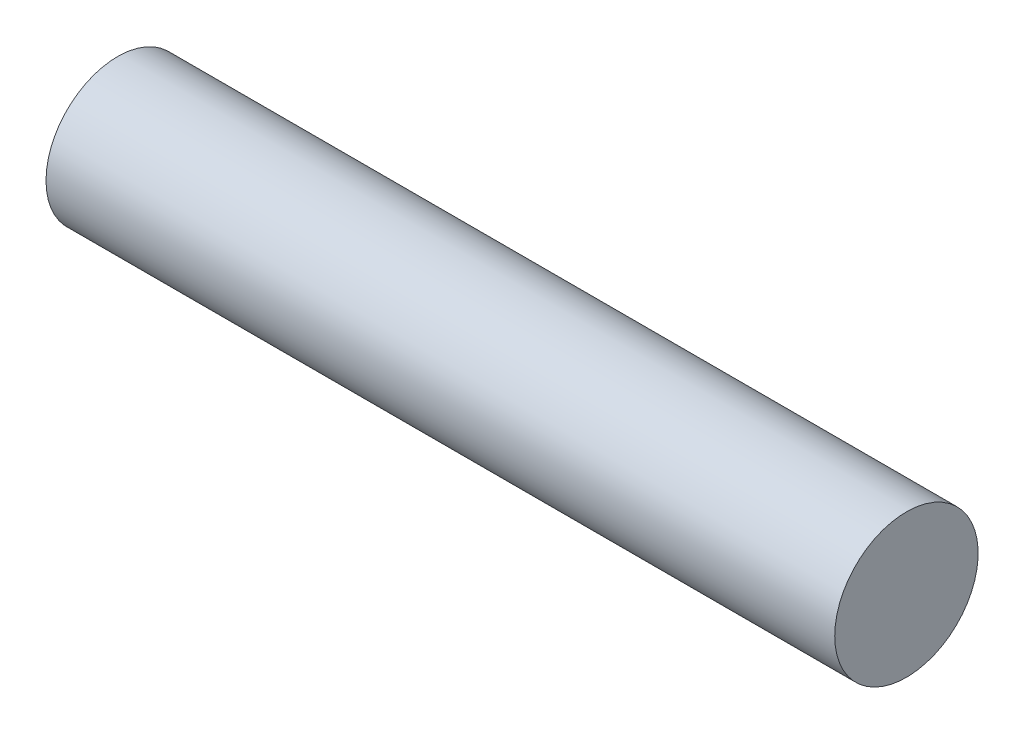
ISO-10303-21;
HEADER;
FILE_DESCRIPTION(('STEP AP214'),'2;1');
FILE_NAME('part.step','',(''),(''),'','','');
FILE_SCHEMA(('AUTOMOTIVE_DESIGN { 1 0 10303 214 1 1 1 1 }'));
ENDSEC;
DATA;
#1=APPLICATION_CONTEXT('core data for automotive mechanical design processes');
#2=APPLICATION_PROTOCOL_DEFINITION('international standard','automotive_design',2000,#1);
#3=PRODUCT_CONTEXT('',#1,'mechanical');
#4=PRODUCT('Part','Part','',(#3));
#5=PRODUCT_RELATED_PRODUCT_CATEGORY('part','',(#4));
#6=PRODUCT_DEFINITION_FORMATION('','',#4);
#7=PRODUCT_DEFINITION_CONTEXT('part definition',#1,'design');
#8=PRODUCT_DEFINITION('design','',#6,#7);
#9=PRODUCT_DEFINITION_SHAPE('','',#8);
#10=(LENGTH_UNIT() NAMED_UNIT(*) SI_UNIT(.MILLI.,.METRE.));
#11=(NAMED_UNIT(*) PLANE_ANGLE_UNIT() SI_UNIT($,.RADIAN.));
#12=(NAMED_UNIT(*) SI_UNIT($,.STERADIAN.) SOLID_ANGLE_UNIT());
#13=UNCERTAINTY_MEASURE_WITH_UNIT(LENGTH_MEASURE(1.E-05),#10,'distance_accuracy_value','');
#14=(GEOMETRIC_REPRESENTATION_CONTEXT(3) GLOBAL_UNCERTAINTY_ASSIGNED_CONTEXT((#13)) GLOBAL_UNIT_ASSIGNED_CONTEXT((#10,
#11,#12)) REPRESENTATION_CONTEXT('',''));
#15=CARTESIAN_POINT('',(0.,0.,0.));
#16=DIRECTION('',(0.,0.,1.));
#17=DIRECTION('',(1.,0.,0.));
#18=AXIS2_PLACEMENT_3D('',#15,#16,#17);
#19=CARTESIAN_POINT('',(0.,0.,-5.));
#20=DIRECTION('',(1.,0.,0.));
#21=DIRECTION('',(0.,0.,-1.));
#22=AXIS2_PLACEMENT_3D('',#19,#20,#21);
#23=PLANE('',#22);
#24=CARTESIAN_POINT('',(0.,0.,0.));
#25=DIRECTION('',(-1.,0.,0.));
#26=DIRECTION('',(0.,0.,1.));
#27=AXIS2_PLACEMENT_3D('',#24,#25,#26);
#28=CIRCLE('',#27,5.);
#29=CARTESIAN_POINT('',(0.,0.,5.));
#30=VERTEX_POINT('',#29);
#31=EDGE_CURVE('E37',#30,#30,#28,.T.);
#32=ORIENTED_EDGE('',*,*,#31,.T.);
#33=EDGE_LOOP('',(#32));
#34=FACE_BOUND('',#33,.T.);
#35=ADVANCED_FACE('F31',(#34),#23,.F.);
#36=CARTESIAN_POINT('',(55.,0.,0.));
#37=DIRECTION('',(-1.,0.,0.));
#38=DIRECTION('',(0.,0.,1.));
#39=AXIS2_PLACEMENT_3D('',#36,#37,#38);
#40=PLANE('',#39);
#41=CARTESIAN_POINT('',(55.,0.,0.));
#42=DIRECTION('',(-1.,0.,0.));
#43=DIRECTION('',(0.,0.,1.));
#44=AXIS2_PLACEMENT_3D('',#41,#42,#43);
#45=CIRCLE('',#44,5.);
#46=CARTESIAN_POINT('',(55.,0.,5.));
#47=VERTEX_POINT('',#46);
#48=EDGE_CURVE('E10',#47,#47,#45,.T.);
#49=ORIENTED_EDGE('',*,*,#48,.F.);
#50=EDGE_LOOP('',(#49));
#51=FACE_BOUND('',#50,.T.);
#52=ADVANCED_FACE('F46',(#51),#40,.F.);
#53=CARTESIAN_POINT('',(0.,0.,0.));
#54=DIRECTION('',(-1.,0.,0.));
#55=DIRECTION('',(0.,0.,1.));
#56=AXIS2_PLACEMENT_3D('',#53,#54,#55);
#57=CYLINDRICAL_SURFACE('',#56,5.);
#58=ORIENTED_EDGE('',*,*,#31,.F.);
#59=EDGE_LOOP('',(#58));
#60=FACE_BOUND('',#59,.T.);
#61=ORIENTED_EDGE('',*,*,#48,.T.);
#62=EDGE_LOOP('',(#61));
#63=FACE_BOUND('',#62,.T.);
#64=ADVANCED_FACE('F44',(#60,#63),#57,.T.);
#65=CLOSED_SHELL('',(#35,#52,#64));
#66=MANIFOLD_SOLID_BREP('B2',#65);
#67=ADVANCED_BREP_SHAPE_REPRESENTATION('',(#18,#66),#14);
#68=SHAPE_DEFINITION_REPRESENTATION(#9,#67);
ENDSEC;
END-ISO-10303-21;
